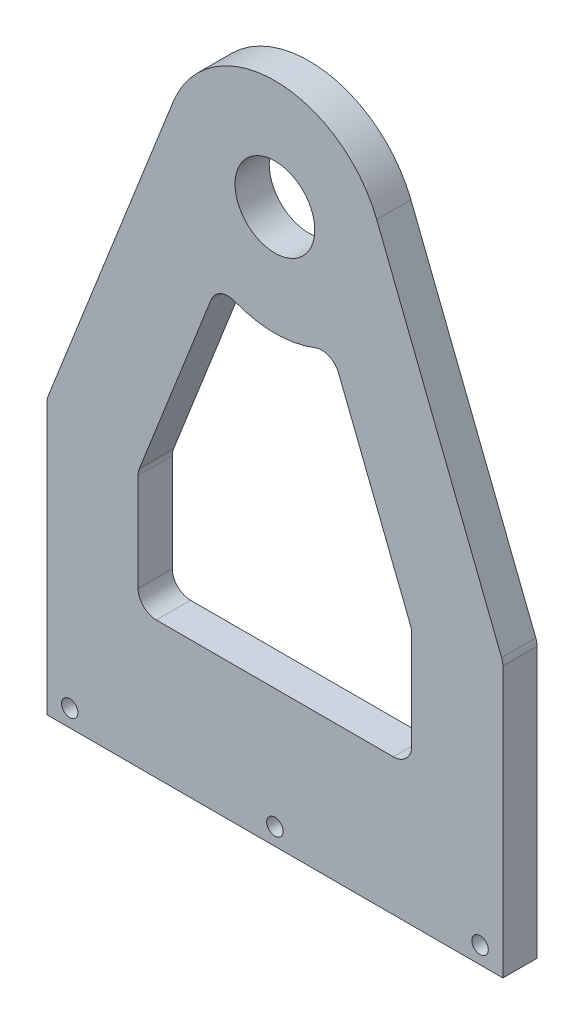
ISO-10303-21;
HEADER;
FILE_DESCRIPTION(('STEP AP214'),'2;1');
FILE_NAME('part.step','',(''),(''),'','','');
FILE_SCHEMA(('AUTOMOTIVE_DESIGN { 1 0 10303 214 1 1 1 1 }'));
ENDSEC;
DATA;
#1=APPLICATION_CONTEXT('core data for automotive mechanical design processes');
#2=APPLICATION_PROTOCOL_DEFINITION('international standard','automotive_design',2000,#1);
#3=PRODUCT_CONTEXT('',#1,'mechanical');
#4=PRODUCT('Part','Part','',(#3));
#5=PRODUCT_RELATED_PRODUCT_CATEGORY('part','',(#4));
#6=PRODUCT_DEFINITION_FORMATION('','',#4);
#7=PRODUCT_DEFINITION_CONTEXT('part definition',#1,'design');
#8=PRODUCT_DEFINITION('design','',#6,#7);
#9=PRODUCT_DEFINITION_SHAPE('','',#8);
#10=(LENGTH_UNIT() NAMED_UNIT(*) SI_UNIT(.MILLI.,.METRE.));
#11=(NAMED_UNIT(*) PLANE_ANGLE_UNIT() SI_UNIT($,.RADIAN.));
#12=(NAMED_UNIT(*) SI_UNIT($,.STERADIAN.) SOLID_ANGLE_UNIT());
#13=UNCERTAINTY_MEASURE_WITH_UNIT(LENGTH_MEASURE(1.E-05),#10,'distance_accuracy_value','');
#14=(GEOMETRIC_REPRESENTATION_CONTEXT(3) GLOBAL_UNCERTAINTY_ASSIGNED_CONTEXT((#13)) GLOBAL_UNIT_ASSIGNED_CONTEXT((#10,
#11,#12)) REPRESENTATION_CONTEXT('',''));
#15=CARTESIAN_POINT('',(0.,0.,0.));
#16=DIRECTION('',(0.,0.,1.));
#17=DIRECTION('',(1.,0.,0.));
#18=AXIS2_PLACEMENT_3D('',#15,#16,#17);
#19=CARTESIAN_POINT('',(0.,77.11694,4.7625));
#20=DIRECTION('',(0.,0.,-1.));
#21=DIRECTION('',(-1.,0.,0.));
#22=AXIS2_PLACEMENT_3D('',#19,#20,#21);
#23=PLANE('',#22);
#24=DIRECTION('',(0.,-1.,0.));
#25=VECTOR('',#24,1.);
#26=CARTESIAN_POINT('',(-19.05,35.6886922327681,4.7625));
#27=LINE('',#26,#25);
#28=CARTESIAN_POINT('',(-19.05,35.2064306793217,4.7625));
#29=VERTEX_POINT('',#28);
#30=CARTESIAN_POINT('',(-19.05,21.59,4.7625));
#31=VERTEX_POINT('',#30);
#32=EDGE_CURVE('E266',#29,#31,#27,.T.);
#33=ORIENTED_EDGE('',*,*,#32,.F.);
#34=CARTESIAN_POINT('',(-16.51,35.2064306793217,4.7625));
#35=DIRECTION('',(0.,0.,-1.));
#36=DIRECTION('',(-1.,0.,0.));
#37=AXIS2_PLACEMENT_3D('',#34,#35,#36);
#38=CIRCLE('',#37,2.54);
#39=CARTESIAN_POINT('',(-18.8732411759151,36.1373931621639,4.7625));
#40=VERTEX_POINT('',#39);
#41=EDGE_CURVE('E38',#29,#40,#38,.T.);
#42=ORIENTED_EDGE('',*,*,#41,.T.);
#43=DIRECTION('',(-0.366520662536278,-0.930409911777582,0.));
#44=VECTOR('',#43,1.);
#45=CARTESIAN_POINT('',(-7.87088949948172,64.0667791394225,4.7625));
#46=LINE('',#45,#44);
#47=CARTESIAN_POINT('',(-8.8799785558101,61.5052142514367,4.7625));
#48=VERTEX_POINT('',#47);
#49=EDGE_CURVE('E264',#48,#40,#46,.T.);
#50=ORIENTED_EDGE('',*,*,#49,.F.);
#51=CARTESIAN_POINT('',(-6.51673737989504,60.5742517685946,4.7625));
#52=DIRECTION('',(0.,0.,-1.));
#53=DIRECTION('',(-1.,0.,0.));
#54=AXIS2_PLACEMENT_3D('',#51,#52,#53);
#55=CIRCLE('',#54,2.54);
#56=CARTESIAN_POINT('',(-5.58577489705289,62.9374929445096,4.7625));
#57=VERTEX_POINT('',#56);
#58=EDGE_CURVE('E244',#48,#57,#55,.T.);
#59=ORIENTED_EDGE('',*,*,#58,.T.);
#60=CARTESIAN_POINT('',(0.,77.11694,4.7625));
#61=DIRECTION('',(0.,0.,-1.));
#62=DIRECTION('',(1.,0.,0.));
#63=AXIS2_PLACEMENT_3D('',#60,#61,#62);
#64=CIRCLE('',#63,15.24);
#65=CARTESIAN_POINT('',(5.58577489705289,62.9374929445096,4.7625));
#66=VERTEX_POINT('',#65);
#67=EDGE_CURVE('E294',#66,#57,#64,.T.);
#68=ORIENTED_EDGE('',*,*,#67,.F.);
#69=CARTESIAN_POINT('',(6.51673737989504,60.5742517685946,4.7625));
#70=DIRECTION('',(0.,0.,-1.));
#71=DIRECTION('',(-1.,0.,0.));
#72=AXIS2_PLACEMENT_3D('',#69,#70,#71);
#73=CIRCLE('',#72,2.54);
#74=CARTESIAN_POINT('',(8.8799785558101,61.5052142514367,4.7625));
#75=VERTEX_POINT('',#74);
#76=EDGE_CURVE('E240',#66,#75,#73,.T.);
#77=ORIENTED_EDGE('',*,*,#76,.T.);
#78=DIRECTION('',(-0.366520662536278,0.930409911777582,0.));
#79=VECTOR('',#78,1.);
#80=CARTESIAN_POINT('',(19.05,35.6886922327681,4.7625));
#81=LINE('',#80,#79);
#82=CARTESIAN_POINT('',(18.8732411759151,36.1373931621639,4.7625));
#83=VERTEX_POINT('',#82);
#84=EDGE_CURVE('E312',#83,#75,#81,.T.);
#85=ORIENTED_EDGE('',*,*,#84,.F.);
#86=CARTESIAN_POINT('',(16.51,35.2064306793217,4.7625));
#87=DIRECTION('',(0.,0.,-1.));
#88=DIRECTION('',(-1.,0.,0.));
#89=AXIS2_PLACEMENT_3D('',#86,#87,#88);
#90=CIRCLE('',#89,2.54);
#91=CARTESIAN_POINT('',(19.05,35.2064306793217,4.7625));
#92=VERTEX_POINT('',#91);
#93=EDGE_CURVE('E248',#83,#92,#90,.T.);
#94=ORIENTED_EDGE('',*,*,#93,.T.);
#95=DIRECTION('',(0.,1.,0.));
#96=VECTOR('',#95,1.);
#97=CARTESIAN_POINT('',(19.05,19.05,4.7625));
#98=LINE('',#97,#96);
#99=CARTESIAN_POINT('',(19.05,21.59,4.7625));
#100=VERTEX_POINT('',#99);
#101=EDGE_CURVE('E309',#100,#92,#98,.T.);
#102=ORIENTED_EDGE('',*,*,#101,.F.);
#103=CARTESIAN_POINT('',(16.51,21.59,4.7625));
#104=DIRECTION('',(0.,0.,-1.));
#105=DIRECTION('',(-1.,0.,0.));
#106=AXIS2_PLACEMENT_3D('',#103,#104,#105);
#107=CIRCLE('',#106,2.54);
#108=CARTESIAN_POINT('',(16.51,19.05,4.7625));
#109=VERTEX_POINT('',#108);
#110=EDGE_CURVE('E252',#100,#109,#107,.T.);
#111=ORIENTED_EDGE('',*,*,#110,.T.);
#112=DIRECTION('',(1.,0.,0.));
#113=VECTOR('',#112,1.);
#114=CARTESIAN_POINT('',(-19.05,19.05,4.7625));
#115=LINE('',#114,#113);
#116=CARTESIAN_POINT('',(-16.51,19.05,4.7625));
#117=VERTEX_POINT('',#116);
#118=EDGE_CURVE('E306',#117,#109,#115,.T.);
#119=ORIENTED_EDGE('',*,*,#118,.F.);
#120=CARTESIAN_POINT('',(-16.51,21.59,4.7625));
#121=DIRECTION('',(0.,0.,-1.));
#122=DIRECTION('',(-1.,0.,0.));
#123=AXIS2_PLACEMENT_3D('',#120,#121,#122);
#124=CIRCLE('',#123,2.54);
#125=EDGE_CURVE('E256',#117,#31,#124,.T.);
#126=ORIENTED_EDGE('',*,*,#125,.T.);
#127=EDGE_LOOP('',(#33,#42,#50,#59,#68,#77,#85,#94,#102,#111,#119,#126));
#128=FACE_BOUND('',#127,.T.);
#129=CARTESIAN_POINT('',(0.,2.38125,4.7625));
#130=DIRECTION('',(0.,0.,1.));
#131=DIRECTION('',(1.,0.,0.));
#132=AXIS2_PLACEMENT_3D('',#129,#130,#131);
#133=CIRCLE('',#132,1.143);
#134=CARTESIAN_POINT('',(1.14300000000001,2.38125,4.7625));
#135=VERTEX_POINT('',#134);
#136=EDGE_CURVE('E303',#135,#135,#133,.T.);
#137=ORIENTED_EDGE('',*,*,#136,.F.);
#138=EDGE_LOOP('',(#137));
#139=FACE_BOUND('',#138,.T.);
#140=CARTESIAN_POINT('',(28.575,2.38125,4.7625));
#141=DIRECTION('',(0.,0.,1.));
#142=DIRECTION('',(-1.,0.,0.));
#143=AXIS2_PLACEMENT_3D('',#140,#141,#142);
#144=CIRCLE('',#143,1.143);
#145=CARTESIAN_POINT('',(29.718,2.38125,4.7625));
#146=VERTEX_POINT('',#145);
#147=EDGE_CURVE('E320',#146,#146,#144,.T.);
#148=ORIENTED_EDGE('',*,*,#147,.F.);
#149=EDGE_LOOP('',(#148));
#150=FACE_BOUND('',#149,.T.);
#151=CARTESIAN_POINT('',(-28.575,2.38125,4.7625));
#152=DIRECTION('',(0.,0.,1.));
#153=DIRECTION('',(1.,0.,0.));
#154=AXIS2_PLACEMENT_3D('',#151,#152,#153);
#155=CIRCLE('',#154,1.143);
#156=CARTESIAN_POINT('',(-27.432,2.38125,4.7625));
#157=VERTEX_POINT('',#156);
#158=EDGE_CURVE('E326',#157,#157,#155,.T.);
#159=ORIENTED_EDGE('',*,*,#158,.F.);
#160=EDGE_LOOP('',(#159));
#161=FACE_BOUND('',#160,.T.);
#162=DIRECTION('',(0.,1.,0.));
#163=VECTOR('',#162,1.);
#164=CARTESIAN_POINT('',(31.75,0.,4.7625));
#165=LINE('',#164,#163);
#166=CARTESIAN_POINT('',(31.75,0.,4.7625));
#167=VERTEX_POINT('',#166);
#168=CARTESIAN_POINT('',(31.75,37.6177384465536,4.7625));
#169=VERTEX_POINT('',#168);
#170=EDGE_CURVE('E184',#167,#169,#165,.T.);
#171=ORIENTED_EDGE('',*,*,#170,.T.);
#172=CARTESIAN_POINT('',(29.21,37.6177384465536,4.7625));
#173=DIRECTION('',(0.,0.,-1.));
#174=DIRECTION('',(-1.,0.,0.));
#175=AXIS2_PLACEMENT_3D('',#172,#173,#174);
#176=CIRCLE('',#175,2.54);
#177=CARTESIAN_POINT('',(31.5732411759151,38.5487009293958,4.7625));
#178=VERTEX_POINT('',#177);
#179=EDGE_CURVE('E205',#169,#178,#176,.F.);
#180=ORIENTED_EDGE('',*,*,#179,.T.);
#181=DIRECTION('',(-0.366520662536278,0.930409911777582,0.));
#182=VECTOR('',#181,1.);
#183=CARTESIAN_POINT('',(31.75,38.1,4.7625));
#184=LINE('',#183,#182);
#185=CARTESIAN_POINT('',(14.1794470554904,82.7027148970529,4.7625));
#186=VERTEX_POINT('',#185);
#187=EDGE_CURVE('E341',#178,#186,#184,.T.);
#188=ORIENTED_EDGE('',*,*,#187,.T.);
#189=CARTESIAN_POINT('',(0.,77.11694,4.7625));
#190=DIRECTION('',(0.,0.,1.));
#191=DIRECTION('',(-1.,0.,0.));
#192=AXIS2_PLACEMENT_3D('',#189,#190,#191);
#193=CIRCLE('',#192,15.24);
#194=CARTESIAN_POINT('',(-14.1794470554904,82.7027148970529,4.7625));
#195=VERTEX_POINT('',#194);
#196=EDGE_CURVE('E343',#186,#195,#193,.T.);
#197=ORIENTED_EDGE('',*,*,#196,.T.);
#198=DIRECTION('',(-0.366520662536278,-0.930409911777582,0.));
#199=VECTOR('',#198,1.);
#200=CARTESIAN_POINT('',(-31.75,38.1,4.7625));
#201=LINE('',#200,#199);
#202=CARTESIAN_POINT('',(-31.5732411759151,38.5487009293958,4.7625));
#203=VERTEX_POINT('',#202);
#204=EDGE_CURVE('E345',#195,#203,#201,.T.);
#205=ORIENTED_EDGE('',*,*,#204,.T.);
#206=CARTESIAN_POINT('',(-29.21,37.6177384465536,4.7625));
#207=DIRECTION('',(0.,0.,-1.));
#208=DIRECTION('',(-1.,0.,0.));
#209=AXIS2_PLACEMENT_3D('',#206,#207,#208);
#210=CIRCLE('',#209,2.54);
#211=CARTESIAN_POINT('',(-31.75,37.6177384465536,4.7625));
#212=VERTEX_POINT('',#211);
#213=EDGE_CURVE('E52',#203,#212,#210,.F.);
#214=ORIENTED_EDGE('',*,*,#213,.T.);
#215=DIRECTION('',(0.,-1.,0.));
#216=VECTOR('',#215,1.);
#217=CARTESIAN_POINT('',(-31.75,0.,4.7625));
#218=LINE('',#217,#216);
#219=CARTESIAN_POINT('',(-31.75,0.,4.7625));
#220=VERTEX_POINT('',#219);
#221=EDGE_CURVE('E165',#212,#220,#218,.T.);
#222=ORIENTED_EDGE('',*,*,#221,.T.);
#223=DIRECTION('',(1.,0.,0.));
#224=VECTOR('',#223,1.);
#225=CARTESIAN_POINT('',(-31.75,0.,4.7625));
#226=LINE('',#225,#224);
#227=EDGE_CURVE('E169',#220,#167,#226,.T.);
#228=ORIENTED_EDGE('',*,*,#227,.T.);
#229=EDGE_LOOP('',(#171,#180,#188,#197,#205,#214,#222,#228));
#230=FACE_BOUND('',#229,.T.);
#231=CARTESIAN_POINT('',(0.,77.11694,4.7625));
#232=DIRECTION('',(0.,0.,1.));
#233=DIRECTION('',(1.,0.,0.));
#234=AXIS2_PLACEMENT_3D('',#231,#232,#233);
#235=CIRCLE('',#234,5.55625);
#236=CARTESIAN_POINT('',(-5.55625,77.11694,4.7625));
#237=VERTEX_POINT('',#236);
#238=EDGE_CURVE('E335',#237,#237,#235,.T.);
#239=ORIENTED_EDGE('',*,*,#238,.F.);
#240=EDGE_LOOP('',(#239));
#241=FACE_BOUND('',#240,.T.);
#242=ADVANCED_FACE('F30',(#128,#139,#150,#161,#230,#241),#23,.F.);
#243=CARTESIAN_POINT('',(0.,77.11694,0.));
#244=DIRECTION('',(0.,0.,-1.));
#245=DIRECTION('',(-1.,0.,0.));
#246=AXIS2_PLACEMENT_3D('',#243,#244,#245);
#247=PLANE('',#246);
#248=CARTESIAN_POINT('',(0.,77.11694,0.));
#249=DIRECTION('',(0.,0.,-1.));
#250=DIRECTION('',(1.,0.,0.));
#251=AXIS2_PLACEMENT_3D('',#248,#249,#250);
#252=CIRCLE('',#251,15.24);
#253=CARTESIAN_POINT('',(5.58577489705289,62.9374929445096,0.));
#254=VERTEX_POINT('',#253);
#255=CARTESIAN_POINT('',(-5.58577489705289,62.9374929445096,0.));
#256=VERTEX_POINT('',#255);
#257=EDGE_CURVE('E302',#254,#256,#252,.T.);
#258=ORIENTED_EDGE('',*,*,#257,.T.);
#259=CARTESIAN_POINT('',(-6.51673737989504,60.5742517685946,0.));
#260=DIRECTION('',(0.,0.,-1.));
#261=DIRECTION('',(-1.,0.,0.));
#262=AXIS2_PLACEMENT_3D('',#259,#260,#261);
#263=CIRCLE('',#262,2.54);
#264=CARTESIAN_POINT('',(-8.8799785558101,61.5052142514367,0.));
#265=VERTEX_POINT('',#264);
#266=EDGE_CURVE('E246',#256,#265,#263,.F.);
#267=ORIENTED_EDGE('',*,*,#266,.T.);
#268=DIRECTION('',(-0.366520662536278,-0.930409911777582,0.));
#269=VECTOR('',#268,1.);
#270=CARTESIAN_POINT('',(-7.87088949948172,64.0667791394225,0.));
#271=LINE('',#270,#269);
#272=CARTESIAN_POINT('',(-18.8732411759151,36.1373931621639,0.));
#273=VERTEX_POINT('',#272);
#274=EDGE_CURVE('E285',#265,#273,#271,.T.);
#275=ORIENTED_EDGE('',*,*,#274,.T.);
#276=CARTESIAN_POINT('',(-16.51,35.2064306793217,0.));
#277=DIRECTION('',(0.,0.,-1.));
#278=DIRECTION('',(-1.,0.,0.));
#279=AXIS2_PLACEMENT_3D('',#276,#277,#278);
#280=CIRCLE('',#279,2.54);
#281=CARTESIAN_POINT('',(-19.05,35.2064306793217,0.));
#282=VERTEX_POINT('',#281);
#283=EDGE_CURVE('E11',#273,#282,#280,.F.);
#284=ORIENTED_EDGE('',*,*,#283,.T.);
#285=DIRECTION('',(0.,-1.,0.));
#286=VECTOR('',#285,1.);
#287=CARTESIAN_POINT('',(-19.05,35.6886922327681,0.));
#288=LINE('',#287,#286);
#289=CARTESIAN_POINT('',(-19.05,21.59,0.));
#290=VERTEX_POINT('',#289);
#291=EDGE_CURVE('E283',#282,#290,#288,.T.);
#292=ORIENTED_EDGE('',*,*,#291,.T.);
#293=CARTESIAN_POINT('',(-16.51,21.59,0.));
#294=DIRECTION('',(0.,0.,-1.));
#295=DIRECTION('',(-1.,0.,0.));
#296=AXIS2_PLACEMENT_3D('',#293,#294,#295);
#297=CIRCLE('',#296,2.54);
#298=CARTESIAN_POINT('',(-16.51,19.05,0.));
#299=VERTEX_POINT('',#298);
#300=EDGE_CURVE('E258',#290,#299,#297,.F.);
#301=ORIENTED_EDGE('',*,*,#300,.T.);
#302=DIRECTION('',(1.,0.,0.));
#303=VECTOR('',#302,1.);
#304=CARTESIAN_POINT('',(-19.05,19.05,0.));
#305=LINE('',#304,#303);
#306=CARTESIAN_POINT('',(16.51,19.05,0.));
#307=VERTEX_POINT('',#306);
#308=EDGE_CURVE('E289',#299,#307,#305,.T.);
#309=ORIENTED_EDGE('',*,*,#308,.T.);
#310=CARTESIAN_POINT('',(16.51,21.59,0.));
#311=DIRECTION('',(0.,0.,-1.));
#312=DIRECTION('',(-1.,0.,0.));
#313=AXIS2_PLACEMENT_3D('',#310,#311,#312);
#314=CIRCLE('',#313,2.54);
#315=CARTESIAN_POINT('',(19.05,21.59,0.));
#316=VERTEX_POINT('',#315);
#317=EDGE_CURVE('E254',#307,#316,#314,.F.);
#318=ORIENTED_EDGE('',*,*,#317,.T.);
#319=DIRECTION('',(0.,1.,0.));
#320=VECTOR('',#319,1.);
#321=CARTESIAN_POINT('',(19.05,19.05,0.));
#322=LINE('',#321,#320);
#323=CARTESIAN_POINT('',(19.05,35.2064306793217,0.));
#324=VERTEX_POINT('',#323);
#325=EDGE_CURVE('E292',#316,#324,#322,.T.);
#326=ORIENTED_EDGE('',*,*,#325,.T.);
#327=CARTESIAN_POINT('',(16.51,35.2064306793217,0.));
#328=DIRECTION('',(0.,0.,-1.));
#329=DIRECTION('',(-1.,0.,0.));
#330=AXIS2_PLACEMENT_3D('',#327,#328,#329);
#331=CIRCLE('',#330,2.54);
#332=CARTESIAN_POINT('',(18.8732411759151,36.1373931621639,0.));
#333=VERTEX_POINT('',#332);
#334=EDGE_CURVE('E250',#324,#333,#331,.F.);
#335=ORIENTED_EDGE('',*,*,#334,.T.);
#336=DIRECTION('',(-0.366520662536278,0.930409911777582,0.));
#337=VECTOR('',#336,1.);
#338=CARTESIAN_POINT('',(19.05,35.6886922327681,0.));
#339=LINE('',#338,#337);
#340=CARTESIAN_POINT('',(8.8799785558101,61.5052142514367,0.));
#341=VERTEX_POINT('',#340);
#342=EDGE_CURVE('E299',#333,#341,#339,.T.);
#343=ORIENTED_EDGE('',*,*,#342,.T.);
#344=CARTESIAN_POINT('',(6.51673737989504,60.5742517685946,0.));
#345=DIRECTION('',(0.,0.,-1.));
#346=DIRECTION('',(-1.,0.,0.));
#347=AXIS2_PLACEMENT_3D('',#344,#345,#346);
#348=CIRCLE('',#347,2.54);
#349=EDGE_CURVE('E242',#341,#254,#348,.F.);
#350=ORIENTED_EDGE('',*,*,#349,.T.);
#351=EDGE_LOOP('',(#258,#267,#275,#284,#292,#301,#309,#318,#326,#335,#343,#350));
#352=FACE_BOUND('',#351,.T.);
#353=CARTESIAN_POINT('',(0.,2.38125,0.));
#354=DIRECTION('',(0.,0.,1.));
#355=DIRECTION('',(1.,0.,0.));
#356=AXIS2_PLACEMENT_3D('',#353,#354,#355);
#357=CIRCLE('',#356,1.143);
#358=CARTESIAN_POINT('',(1.14300000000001,2.38125,0.));
#359=VERTEX_POINT('',#358);
#360=EDGE_CURVE('E317',#359,#359,#357,.T.);
#361=ORIENTED_EDGE('',*,*,#360,.T.);
#362=EDGE_LOOP('',(#361));
#363=FACE_BOUND('',#362,.T.);
#364=CARTESIAN_POINT('',(28.575,2.38125,0.));
#365=DIRECTION('',(0.,0.,1.));
#366=DIRECTION('',(-1.,0.,0.));
#367=AXIS2_PLACEMENT_3D('',#364,#365,#366);
#368=CIRCLE('',#367,1.143);
#369=CARTESIAN_POINT('',(29.718,2.38125,0.));
#370=VERTEX_POINT('',#369);
#371=EDGE_CURVE('E323',#370,#370,#368,.T.);
#372=ORIENTED_EDGE('',*,*,#371,.T.);
#373=EDGE_LOOP('',(#372));
#374=FACE_BOUND('',#373,.T.);
#375=CARTESIAN_POINT('',(-28.575,2.38125,0.));
#376=DIRECTION('',(0.,0.,1.));
#377=DIRECTION('',(1.,0.,0.));
#378=AXIS2_PLACEMENT_3D('',#375,#376,#377);
#379=CIRCLE('',#378,1.143);
#380=CARTESIAN_POINT('',(-27.432,2.38125,0.));
#381=VERTEX_POINT('',#380);
#382=EDGE_CURVE('E329',#381,#381,#379,.T.);
#383=ORIENTED_EDGE('',*,*,#382,.T.);
#384=EDGE_LOOP('',(#383));
#385=FACE_BOUND('',#384,.T.);
#386=DIRECTION('',(-0.366520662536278,0.930409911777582,0.));
#387=VECTOR('',#386,1.);
#388=CARTESIAN_POINT('',(31.75,38.1,0.));
#389=LINE('',#388,#387);
#390=CARTESIAN_POINT('',(31.5732411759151,38.5487009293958,0.));
#391=VERTEX_POINT('',#390);
#392=CARTESIAN_POINT('',(14.1794470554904,82.7027148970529,0.));
#393=VERTEX_POINT('',#392);
#394=EDGE_CURVE('E354',#391,#393,#389,.T.);
#395=ORIENTED_EDGE('',*,*,#394,.F.);
#396=CARTESIAN_POINT('',(29.21,37.6177384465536,0.));
#397=DIRECTION('',(0.,0.,-1.));
#398=DIRECTION('',(-1.,0.,0.));
#399=AXIS2_PLACEMENT_3D('',#396,#397,#398);
#400=CIRCLE('',#399,2.54);
#401=CARTESIAN_POINT('',(31.75,37.6177384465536,0.));
#402=VERTEX_POINT('',#401);
#403=EDGE_CURVE('E200',#391,#402,#400,.T.);
#404=ORIENTED_EDGE('',*,*,#403,.T.);
#405=DIRECTION('',(0.,1.,0.));
#406=VECTOR('',#405,1.);
#407=CARTESIAN_POINT('',(31.75,0.,0.));
#408=LINE('',#407,#406);
#409=CARTESIAN_POINT('',(31.75,0.,0.));
#410=VERTEX_POINT('',#409);
#411=EDGE_CURVE('E351',#410,#402,#408,.T.);
#412=ORIENTED_EDGE('',*,*,#411,.F.);
#413=DIRECTION('',(1.,0.,0.));
#414=VECTOR('',#413,1.);
#415=CARTESIAN_POINT('',(-31.75,0.,0.));
#416=LINE('',#415,#414);
#417=CARTESIAN_POINT('',(-31.75,0.,0.));
#418=VERTEX_POINT('',#417);
#419=EDGE_CURVE('E349',#418,#410,#416,.T.);
#420=ORIENTED_EDGE('',*,*,#419,.F.);
#421=DIRECTION('',(0.,-1.,0.));
#422=VECTOR('',#421,1.);
#423=CARTESIAN_POINT('',(-31.75,0.,0.));
#424=LINE('',#423,#422);
#425=CARTESIAN_POINT('',(-31.75,37.6177384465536,0.));
#426=VERTEX_POINT('',#425);
#427=EDGE_CURVE('E188',#426,#418,#424,.T.);
#428=ORIENTED_EDGE('',*,*,#427,.F.);
#429=CARTESIAN_POINT('',(-29.21,37.6177384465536,0.));
#430=DIRECTION('',(0.,0.,-1.));
#431=DIRECTION('',(-1.,0.,0.));
#432=AXIS2_PLACEMENT_3D('',#429,#430,#431);
#433=CIRCLE('',#432,2.54);
#434=CARTESIAN_POINT('',(-31.5732411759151,38.5487009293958,0.));
#435=VERTEX_POINT('',#434);
#436=EDGE_CURVE('E193',#426,#435,#433,.T.);
#437=ORIENTED_EDGE('',*,*,#436,.T.);
#438=DIRECTION('',(-0.366520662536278,-0.930409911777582,0.));
#439=VECTOR('',#438,1.);
#440=CARTESIAN_POINT('',(-31.75,38.1,0.));
#441=LINE('',#440,#439);
#442=CARTESIAN_POINT('',(-14.1794470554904,82.7027148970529,0.));
#443=VERTEX_POINT('',#442);
#444=EDGE_CURVE('E175',#443,#435,#441,.T.);
#445=ORIENTED_EDGE('',*,*,#444,.F.);
#446=CARTESIAN_POINT('',(0.,77.11694,0.));
#447=DIRECTION('',(0.,0.,1.));
#448=DIRECTION('',(-1.,0.,0.));
#449=AXIS2_PLACEMENT_3D('',#446,#447,#448);
#450=CIRCLE('',#449,15.24);
#451=EDGE_CURVE('E356',#393,#443,#450,.T.);
#452=ORIENTED_EDGE('',*,*,#451,.F.);
#453=EDGE_LOOP('',(#395,#404,#412,#420,#428,#437,#445,#452));
#454=FACE_BOUND('',#453,.T.);
#455=CARTESIAN_POINT('',(0.,77.11694,0.));
#456=DIRECTION('',(0.,0.,1.));
#457=DIRECTION('',(1.,0.,0.));
#458=AXIS2_PLACEMENT_3D('',#455,#456,#457);
#459=CIRCLE('',#458,5.55625);
#460=CARTESIAN_POINT('',(-5.55625,77.11694,0.));
#461=VERTEX_POINT('',#460);
#462=EDGE_CURVE('E332',#461,#461,#459,.T.);
#463=ORIENTED_EDGE('',*,*,#462,.T.);
#464=EDGE_LOOP('',(#463));
#465=FACE_BOUND('',#464,.T.);
#466=ADVANCED_FACE('F281',(#352,#363,#374,#385,#454,#465),#247,.T.);
#467=CARTESIAN_POINT('',(-31.75,0.,4.7625));
#468=DIRECTION('',(1.,0.,0.));
#469=DIRECTION('',(0.,0.,-1.));
#470=AXIS2_PLACEMENT_3D('',#467,#468,#469);
#471=PLANE('',#470);
#472=ORIENTED_EDGE('',*,*,#221,.F.);
#473=DIRECTION('',(0.,0.,-1.));
#474=VECTOR('',#473,1.);
#475=CARTESIAN_POINT('',(-31.75,37.6177384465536,4.7625));
#476=LINE('',#475,#474);
#477=EDGE_CURVE('E207',#212,#426,#476,.T.);
#478=ORIENTED_EDGE('',*,*,#477,.T.);
#479=ORIENTED_EDGE('',*,*,#427,.T.);
#480=DIRECTION('',(0.,0.,-1.));
#481=VECTOR('',#480,1.);
#482=CARTESIAN_POINT('',(-31.75,0.,4.7625));
#483=LINE('',#482,#481);
#484=EDGE_CURVE('E180',#220,#418,#483,.T.);
#485=ORIENTED_EDGE('',*,*,#484,.F.);
#486=EDGE_LOOP('',(#472,#478,#479,#485));
#487=FACE_BOUND('',#486,.T.);
#488=ADVANCED_FACE('F186',(#487),#471,.F.);
#489=CARTESIAN_POINT('',(-31.75,0.,4.7625));
#490=DIRECTION('',(0.,1.,0.));
#491=DIRECTION('',(0.,0.,1.));
#492=AXIS2_PLACEMENT_3D('',#489,#490,#491);
#493=PLANE('',#492);
#494=ORIENTED_EDGE('',*,*,#419,.T.);
#495=DIRECTION('',(0.,0.,-1.));
#496=VECTOR('',#495,1.);
#497=CARTESIAN_POINT('',(31.75,0.,4.7625));
#498=LINE('',#497,#496);
#499=EDGE_CURVE('E182',#167,#410,#498,.T.);
#500=ORIENTED_EDGE('',*,*,#499,.F.);
#501=ORIENTED_EDGE('',*,*,#227,.F.);
#502=ORIENTED_EDGE('',*,*,#484,.T.);
#503=EDGE_LOOP('',(#494,#500,#501,#502));
#504=FACE_BOUND('',#503,.T.);
#505=ADVANCED_FACE('F179',(#504),#493,.F.);
#506=CARTESIAN_POINT('',(31.75,0.,4.7625));
#507=DIRECTION('',(-1.,0.,0.));
#508=DIRECTION('',(0.,0.,1.));
#509=AXIS2_PLACEMENT_3D('',#506,#507,#508);
#510=PLANE('',#509);
#511=ORIENTED_EDGE('',*,*,#411,.T.);
#512=DIRECTION('',(0.,0.,-1.));
#513=VECTOR('',#512,1.);
#514=CARTESIAN_POINT('',(31.75,37.6177384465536,4.7625));
#515=LINE('',#514,#513);
#516=EDGE_CURVE('E202',#402,#169,#515,.F.);
#517=ORIENTED_EDGE('',*,*,#516,.T.);
#518=ORIENTED_EDGE('',*,*,#170,.F.);
#519=ORIENTED_EDGE('',*,*,#499,.T.);
#520=EDGE_LOOP('',(#511,#517,#518,#519));
#521=FACE_BOUND('',#520,.T.);
#522=ADVANCED_FACE('F378',(#521),#510,.F.);
#523=CARTESIAN_POINT('',(31.75,38.1,4.7625));
#524=DIRECTION('',(-0.930409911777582,-0.366520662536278,0.));
#525=DIRECTION('',(0.366520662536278,-0.930409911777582,0.));
#526=AXIS2_PLACEMENT_3D('',#523,#524,#525);
#527=PLANE('',#526);
#528=ORIENTED_EDGE('',*,*,#187,.F.);
#529=DIRECTION('',(0.,0.,-1.));
#530=VECTOR('',#529,1.);
#531=CARTESIAN_POINT('',(31.5732411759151,38.5487009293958,4.7625));
#532=LINE('',#531,#530);
#533=EDGE_CURVE('E190',#178,#391,#532,.T.);
#534=ORIENTED_EDGE('',*,*,#533,.T.);
#535=ORIENTED_EDGE('',*,*,#394,.T.);
#536=DIRECTION('',(0.,0.,-1.));
#537=VECTOR('',#536,1.);
#538=CARTESIAN_POINT('',(14.1794470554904,82.7027148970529,4.7625));
#539=LINE('',#538,#537);
#540=EDGE_CURVE('E195',#186,#393,#539,.T.);
#541=ORIENTED_EDGE('',*,*,#540,.F.);
#542=EDGE_LOOP('',(#528,#534,#535,#541));
#543=FACE_BOUND('',#542,.T.);
#544=ADVANCED_FACE('F384',(#543),#527,.F.);
#545=CARTESIAN_POINT('',(0.,77.11694,4.7625));
#546=DIRECTION('',(0.,0.,-1.));
#547=DIRECTION('',(-1.,0.,0.));
#548=AXIS2_PLACEMENT_3D('',#545,#546,#547);
#549=CYLINDRICAL_SURFACE('',#548,15.24);
#550=ORIENTED_EDGE('',*,*,#451,.T.);
#551=DIRECTION('',(0.,0.,-1.));
#552=VECTOR('',#551,1.);
#553=CARTESIAN_POINT('',(-14.1794470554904,82.7027148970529,4.7625));
#554=LINE('',#553,#552);
#555=EDGE_CURVE('E347',#195,#443,#554,.T.);
#556=ORIENTED_EDGE('',*,*,#555,.F.);
#557=ORIENTED_EDGE('',*,*,#196,.F.);
#558=ORIENTED_EDGE('',*,*,#540,.T.);
#559=EDGE_LOOP('',(#550,#556,#557,#558));
#560=FACE_BOUND('',#559,.T.);
#561=ADVANCED_FACE('F365',(#560),#549,.T.);
#562=CARTESIAN_POINT('',(-31.75,38.1,4.7625));
#563=DIRECTION('',(0.930409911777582,-0.366520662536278,0.));
#564=DIRECTION('',(0.366520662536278,0.930409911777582,0.));
#565=AXIS2_PLACEMENT_3D('',#562,#563,#564);
#566=PLANE('',#565);
#567=ORIENTED_EDGE('',*,*,#444,.T.);
#568=DIRECTION('',(0.,0.,-1.));
#569=VECTOR('',#568,1.);
#570=CARTESIAN_POINT('',(-31.5732411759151,38.5487009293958,4.7625));
#571=LINE('',#570,#569);
#572=EDGE_CURVE('E45',#435,#203,#571,.F.);
#573=ORIENTED_EDGE('',*,*,#572,.T.);
#574=ORIENTED_EDGE('',*,*,#204,.F.);
#575=ORIENTED_EDGE('',*,*,#555,.T.);
#576=EDGE_LOOP('',(#567,#573,#574,#575));
#577=FACE_BOUND('',#576,.T.);
#578=ADVANCED_FACE('F373',(#577),#566,.F.);
#579=CARTESIAN_POINT('',(0.,77.11694,4.7625));
#580=DIRECTION('',(0.,0.,-1.));
#581=DIRECTION('',(-1.,0.,0.));
#582=AXIS2_PLACEMENT_3D('',#579,#580,#581);
#583=CYLINDRICAL_SURFACE('',#582,5.55625);
#584=CARTESIAN_POINT('',(-5.55625,77.11694,4.7625));
#585=CARTESIAN_POINT('',(-5.55625,77.11694,4.712890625));
#586=CARTESIAN_POINT('',(-5.55625,77.11694,4.66328125));
#587=CARTESIAN_POINT('',(-5.55625,77.11694,4.5640625));
#588=CARTESIAN_POINT('',(-5.55625,77.11694,4.514453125));
#589=CARTESIAN_POINT('',(-5.55625,77.11694,4.415234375));
#590=CARTESIAN_POINT('',(-5.55625,77.11694,4.365625));
#591=CARTESIAN_POINT('',(-5.55625,77.11694,4.26640625));
#592=CARTESIAN_POINT('',(-5.55625,77.11694,4.216796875));
#593=CARTESIAN_POINT('',(-5.55625,77.11694,4.117578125));
#594=CARTESIAN_POINT('',(-5.55625,77.11694,4.06796875));
#595=CARTESIAN_POINT('',(-5.55625,77.11694,3.96875));
#596=CARTESIAN_POINT('',(-5.55625,77.11694,3.919140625));
#597=CARTESIAN_POINT('',(-5.55625,77.11694,3.819921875));
#598=CARTESIAN_POINT('',(-5.55625,77.11694,3.7703125));
#599=CARTESIAN_POINT('',(-5.55625,77.11694,3.67109375));
#600=CARTESIAN_POINT('',(-5.55625,77.11694,3.621484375));
#601=CARTESIAN_POINT('',(-5.55625,77.11694,3.522265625));
#602=CARTESIAN_POINT('',(-5.55625,77.11694,3.47265625));
#603=CARTESIAN_POINT('',(-5.55625,77.11694,3.3734375));
#604=CARTESIAN_POINT('',(-5.55625,77.11694,3.323828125));
#605=CARTESIAN_POINT('',(-5.55625,77.11694,3.224609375));
#606=CARTESIAN_POINT('',(-5.55625,77.11694,3.175));
#607=CARTESIAN_POINT('',(-5.55625,77.11694,3.07578125));
#608=CARTESIAN_POINT('',(-5.55625,77.11694,3.026171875));
#609=CARTESIAN_POINT('',(-5.55625,77.11694,2.926953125));
#610=CARTESIAN_POINT('',(-5.55625,77.11694,2.87734375));
#611=CARTESIAN_POINT('',(-5.55625,77.11694,2.778125));
#612=CARTESIAN_POINT('',(-5.55625,77.11694,2.728515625));
#613=CARTESIAN_POINT('',(-5.55625,77.11694,2.629296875));
#614=CARTESIAN_POINT('',(-5.55625,77.11694,2.5796875));
#615=CARTESIAN_POINT('',(-5.55625,77.11694,2.48046875));
#616=CARTESIAN_POINT('',(-5.55625,77.11694,2.430859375));
#617=CARTESIAN_POINT('',(-5.55625,77.11694,2.331640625));
#618=CARTESIAN_POINT('',(-5.55625,77.11694,2.28203125));
#619=CARTESIAN_POINT('',(-5.55625,77.11694,2.1828125));
#620=CARTESIAN_POINT('',(-5.55625,77.11694,2.133203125));
#621=CARTESIAN_POINT('',(-5.55625,77.11694,2.033984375));
#622=CARTESIAN_POINT('',(-5.55625,77.11694,1.984375));
#623=CARTESIAN_POINT('',(-5.55625,77.11694,1.88515625));
#624=CARTESIAN_POINT('',(-5.55625,77.11694,1.835546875));
#625=CARTESIAN_POINT('',(-5.55625,77.11694,1.736328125));
#626=CARTESIAN_POINT('',(-5.55625,77.11694,1.68671875));
#627=CARTESIAN_POINT('',(-5.55625,77.11694,1.5875));
#628=CARTESIAN_POINT('',(-5.55625,77.11694,1.537890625));
#629=CARTESIAN_POINT('',(-5.55625,77.11694,1.438671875));
#630=CARTESIAN_POINT('',(-5.55625,77.11694,1.3890625));
#631=CARTESIAN_POINT('',(-5.55625,77.11694,1.28984375));
#632=CARTESIAN_POINT('',(-5.55625,77.11694,1.240234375));
#633=CARTESIAN_POINT('',(-5.55625,77.11694,1.141015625));
#634=CARTESIAN_POINT('',(-5.55625,77.11694,1.09140625));
#635=CARTESIAN_POINT('',(-5.55625,77.11694,0.9921875));
#636=CARTESIAN_POINT('',(-5.55625,77.11694,0.942578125));
#637=CARTESIAN_POINT('',(-5.55625,77.11694,0.843359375));
#638=CARTESIAN_POINT('',(-5.55625,77.11694,0.79375));
#639=CARTESIAN_POINT('',(-5.55625,77.11694,0.69453125));
#640=CARTESIAN_POINT('',(-5.55625,77.11694,0.644921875));
#641=CARTESIAN_POINT('',(-5.55625,77.11694,0.545703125));
#642=CARTESIAN_POINT('',(-5.55625,77.11694,0.49609375));
#643=CARTESIAN_POINT('',(-5.55625,77.11694,0.396875));
#644=CARTESIAN_POINT('',(-5.55625,77.11694,0.347265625));
#645=CARTESIAN_POINT('',(-5.55625,77.11694,0.248046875));
#646=CARTESIAN_POINT('',(-5.55625,77.11694,0.1984375));
#647=CARTESIAN_POINT('',(-5.55625,77.11694,0.09921875));
#648=CARTESIAN_POINT('',(-5.55625,77.11694,0.049609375));
#649=CARTESIAN_POINT('',(-5.55625,77.11694,0.));
#650=B_SPLINE_CURVE_WITH_KNOTS('',3,(#584,#585,#586,#587,#588,#589,#590,#591,#592,#593,#594,
#595,#596,#597,#598,#599,#600,#601,#602,#603,#604,#605,#606,#607,#608,#609,#610,#611,#612,#613,
#614,#615,#616,#617,#618,#619,#620,#621,#622,#623,#624,#625,#626,#627,#628,#629,#630,#631,#632,
#633,#634,#635,#636,#637,#638,#639,#640,#641,#642,#643,#644,#645,#646,#647,#648,#649),
.UNSPECIFIED.,.F.,.F.,(4,2,2,2,2,2,2,2,2,2,2,2,2,2,2,2,2,2,2,2,2,2,2,2,2,2,2,2,2,2,2,2,4),(0.,
0.148828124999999,0.297656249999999,0.446484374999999,0.595312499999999,0.744140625,0.89296875,
1.041796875,1.190625,1.339453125,1.48828125,1.637109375,1.7859375,1.934765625,2.08359375,
2.232421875,2.38125,2.530078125,2.67890625,2.827734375,2.9765625,3.125390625,3.27421875,
3.423046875,3.571875,3.720703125,3.86953125,4.018359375,4.1671875,4.316015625,4.46484375,
4.613671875,4.7625),.UNSPECIFIED.);
#651=EDGE_CURVE('BSEAM400',#237,#461,#650,.T.);
#652=ORIENTED_EDGE('',*,*,#238,.T.);
#653=ORIENTED_EDGE('',*,*,#462,.F.);
#654=ORIENTED_EDGE('',*,*,#651,.T.);
#655=ORIENTED_EDGE('',*,*,#651,.F.);
#656=EDGE_LOOP('',(#652,#654,#653,#655));
#657=FACE_BOUND('',#656,.T.);
#658=ADVANCED_FACE('F400',(#657),#583,.F.);
#659=CARTESIAN_POINT('',(-28.575,2.38125,0.));
#660=DIRECTION('',(0.,0.,1.));
#661=DIRECTION('',(1.,0.,0.));
#662=AXIS2_PLACEMENT_3D('',#659,#660,#661);
#663=CYLINDRICAL_SURFACE('',#662,1.143);
#664=CARTESIAN_POINT('',(-27.432,2.38125,0.));
#665=CARTESIAN_POINT('',(-27.432,2.38125,0.049609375));
#666=CARTESIAN_POINT('',(-27.432,2.38125,0.09921875));
#667=CARTESIAN_POINT('',(-27.432,2.38125,0.1984375));
#668=CARTESIAN_POINT('',(-27.432,2.38125,0.248046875));
#669=CARTESIAN_POINT('',(-27.432,2.38125,0.347265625));
#670=CARTESIAN_POINT('',(-27.432,2.38125,0.396875));
#671=CARTESIAN_POINT('',(-27.432,2.38125,0.49609375));
#672=CARTESIAN_POINT('',(-27.432,2.38125,0.545703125));
#673=CARTESIAN_POINT('',(-27.432,2.38125,0.644921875));
#674=CARTESIAN_POINT('',(-27.432,2.38125,0.69453125));
#675=CARTESIAN_POINT('',(-27.432,2.38125,0.79375));
#676=CARTESIAN_POINT('',(-27.432,2.38125,0.843359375));
#677=CARTESIAN_POINT('',(-27.432,2.38125,0.942578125));
#678=CARTESIAN_POINT('',(-27.432,2.38125,0.9921875));
#679=CARTESIAN_POINT('',(-27.432,2.38125,1.09140625));
#680=CARTESIAN_POINT('',(-27.432,2.38125,1.141015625));
#681=CARTESIAN_POINT('',(-27.432,2.38125,1.240234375));
#682=CARTESIAN_POINT('',(-27.432,2.38125,1.28984375));
#683=CARTESIAN_POINT('',(-27.432,2.38125,1.3890625));
#684=CARTESIAN_POINT('',(-27.432,2.38125,1.438671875));
#685=CARTESIAN_POINT('',(-27.432,2.38125,1.537890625));
#686=CARTESIAN_POINT('',(-27.432,2.38125,1.5875));
#687=CARTESIAN_POINT('',(-27.432,2.38125,1.68671875));
#688=CARTESIAN_POINT('',(-27.432,2.38125,1.736328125));
#689=CARTESIAN_POINT('',(-27.432,2.38125,1.835546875));
#690=CARTESIAN_POINT('',(-27.432,2.38125,1.88515625));
#691=CARTESIAN_POINT('',(-27.432,2.38125,1.984375));
#692=CARTESIAN_POINT('',(-27.432,2.38125,2.033984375));
#693=CARTESIAN_POINT('',(-27.432,2.38125,2.133203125));
#694=CARTESIAN_POINT('',(-27.432,2.38125,2.1828125));
#695=CARTESIAN_POINT('',(-27.432,2.38125,2.28203125));
#696=CARTESIAN_POINT('',(-27.432,2.38125,2.331640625));
#697=CARTESIAN_POINT('',(-27.432,2.38125,2.430859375));
#698=CARTESIAN_POINT('',(-27.432,2.38125,2.48046875));
#699=CARTESIAN_POINT('',(-27.432,2.38125,2.5796875));
#700=CARTESIAN_POINT('',(-27.432,2.38125,2.629296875));
#701=CARTESIAN_POINT('',(-27.432,2.38125,2.728515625));
#702=CARTESIAN_POINT('',(-27.432,2.38125,2.778125));
#703=CARTESIAN_POINT('',(-27.432,2.38125,2.87734375));
#704=CARTESIAN_POINT('',(-27.432,2.38125,2.926953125));
#705=CARTESIAN_POINT('',(-27.432,2.38125,3.026171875));
#706=CARTESIAN_POINT('',(-27.432,2.38125,3.07578125));
#707=CARTESIAN_POINT('',(-27.432,2.38125,3.175));
#708=CARTESIAN_POINT('',(-27.432,2.38125,3.224609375));
#709=CARTESIAN_POINT('',(-27.432,2.38125,3.323828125));
#710=CARTESIAN_POINT('',(-27.432,2.38125,3.3734375));
#711=CARTESIAN_POINT('',(-27.432,2.38125,3.47265625));
#712=CARTESIAN_POINT('',(-27.432,2.38125,3.522265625));
#713=CARTESIAN_POINT('',(-27.432,2.38125,3.621484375));
#714=CARTESIAN_POINT('',(-27.432,2.38125,3.67109375));
#715=CARTESIAN_POINT('',(-27.432,2.38125,3.7703125));
#716=CARTESIAN_POINT('',(-27.432,2.38125,3.819921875));
#717=CARTESIAN_POINT('',(-27.432,2.38125,3.919140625));
#718=CARTESIAN_POINT('',(-27.432,2.38125,3.96875));
#719=CARTESIAN_POINT('',(-27.432,2.38125,4.06796875));
#720=CARTESIAN_POINT('',(-27.432,2.38125,4.117578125));
#721=CARTESIAN_POINT('',(-27.432,2.38125,4.216796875));
#722=CARTESIAN_POINT('',(-27.432,2.38125,4.26640625));
#723=CARTESIAN_POINT('',(-27.432,2.38125,4.365625));
#724=CARTESIAN_POINT('',(-27.432,2.38125,4.415234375));
#725=CARTESIAN_POINT('',(-27.432,2.38125,4.514453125));
#726=CARTESIAN_POINT('',(-27.432,2.38125,4.5640625));
#727=CARTESIAN_POINT('',(-27.432,2.38125,4.66328125));
#728=CARTESIAN_POINT('',(-27.432,2.38125,4.712890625));
#729=CARTESIAN_POINT('',(-27.432,2.38125,4.7625));
#730=B_SPLINE_CURVE_WITH_KNOTS('',3,(#664,#665,#666,#667,#668,#669,#670,#671,#672,#673,#674,
#675,#676,#677,#678,#679,#680,#681,#682,#683,#684,#685,#686,#687,#688,#689,#690,#691,#692,#693,
#694,#695,#696,#697,#698,#699,#700,#701,#702,#703,#704,#705,#706,#707,#708,#709,#710,#711,#712,
#713,#714,#715,#716,#717,#718,#719,#720,#721,#722,#723,#724,#725,#726,#727,#728,#729),
.UNSPECIFIED.,.F.,.F.,(4,2,2,2,2,2,2,2,2,2,2,2,2,2,2,2,2,2,2,2,2,2,2,2,2,2,2,2,2,2,2,2,4),(0.,
0.148828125,0.29765625,0.446484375,0.5953125,0.744140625,0.89296875,1.041796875,1.190625,
1.339453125,1.48828125,1.637109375,1.7859375,1.934765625,2.08359375,2.232421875,2.38125,
2.530078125,2.67890625,2.827734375,2.9765625,3.125390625,3.27421875,3.423046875,3.571875,
3.720703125,3.86953125,4.018359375,4.1671875,4.316015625,4.46484375,4.613671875,4.7625),.UNSPECIFIED.);
#731=EDGE_CURVE('BSEAM407',#381,#157,#730,.T.);
#732=ORIENTED_EDGE('',*,*,#382,.F.);
#733=ORIENTED_EDGE('',*,*,#158,.T.);
#734=ORIENTED_EDGE('',*,*,#731,.T.);
#735=ORIENTED_EDGE('',*,*,#731,.F.);
#736=EDGE_LOOP('',(#732,#734,#733,#735));
#737=FACE_BOUND('',#736,.T.);
#738=ADVANCED_FACE('F407',(#737),#663,.F.);
#739=CARTESIAN_POINT('',(28.575,2.38125,0.));
#740=DIRECTION('',(0.,0.,1.));
#741=DIRECTION('',(1.,0.,0.));
#742=AXIS2_PLACEMENT_3D('',#739,#740,#741);
#743=CYLINDRICAL_SURFACE('',#742,1.143);
#744=CARTESIAN_POINT('',(29.718,2.38125,0.));
#745=CARTESIAN_POINT('',(29.718,2.38125,0.049609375));
#746=CARTESIAN_POINT('',(29.718,2.38125,0.09921875));
#747=CARTESIAN_POINT('',(29.718,2.38125,0.1984375));
#748=CARTESIAN_POINT('',(29.718,2.38125,0.248046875));
#749=CARTESIAN_POINT('',(29.718,2.38125,0.347265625));
#750=CARTESIAN_POINT('',(29.718,2.38125,0.396875));
#751=CARTESIAN_POINT('',(29.718,2.38125,0.49609375));
#752=CARTESIAN_POINT('',(29.718,2.38125,0.545703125));
#753=CARTESIAN_POINT('',(29.718,2.38125,0.644921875));
#754=CARTESIAN_POINT('',(29.718,2.38125,0.69453125));
#755=CARTESIAN_POINT('',(29.718,2.38125,0.79375));
#756=CARTESIAN_POINT('',(29.718,2.38125,0.843359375));
#757=CARTESIAN_POINT('',(29.718,2.38125,0.942578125));
#758=CARTESIAN_POINT('',(29.718,2.38125,0.9921875));
#759=CARTESIAN_POINT('',(29.718,2.38125,1.09140625));
#760=CARTESIAN_POINT('',(29.718,2.38125,1.141015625));
#761=CARTESIAN_POINT('',(29.718,2.38125,1.240234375));
#762=CARTESIAN_POINT('',(29.718,2.38125,1.28984375));
#763=CARTESIAN_POINT('',(29.718,2.38125,1.3890625));
#764=CARTESIAN_POINT('',(29.718,2.38125,1.438671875));
#765=CARTESIAN_POINT('',(29.718,2.38125,1.537890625));
#766=CARTESIAN_POINT('',(29.718,2.38125,1.5875));
#767=CARTESIAN_POINT('',(29.718,2.38125,1.68671875));
#768=CARTESIAN_POINT('',(29.718,2.38125,1.736328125));
#769=CARTESIAN_POINT('',(29.718,2.38125,1.835546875));
#770=CARTESIAN_POINT('',(29.718,2.38125,1.88515625));
#771=CARTESIAN_POINT('',(29.718,2.38125,1.984375));
#772=CARTESIAN_POINT('',(29.718,2.38125,2.033984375));
#773=CARTESIAN_POINT('',(29.718,2.38125,2.133203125));
#774=CARTESIAN_POINT('',(29.718,2.38125,2.1828125));
#775=CARTESIAN_POINT('',(29.718,2.38125,2.28203125));
#776=CARTESIAN_POINT('',(29.718,2.38125,2.331640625));
#777=CARTESIAN_POINT('',(29.718,2.38125,2.430859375));
#778=CARTESIAN_POINT('',(29.718,2.38125,2.48046875));
#779=CARTESIAN_POINT('',(29.718,2.38125,2.5796875));
#780=CARTESIAN_POINT('',(29.718,2.38125,2.629296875));
#781=CARTESIAN_POINT('',(29.718,2.38125,2.728515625));
#782=CARTESIAN_POINT('',(29.718,2.38125,2.778125));
#783=CARTESIAN_POINT('',(29.718,2.38125,2.87734375));
#784=CARTESIAN_POINT('',(29.718,2.38125,2.926953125));
#785=CARTESIAN_POINT('',(29.718,2.38125,3.026171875));
#786=CARTESIAN_POINT('',(29.718,2.38125,3.07578125));
#787=CARTESIAN_POINT('',(29.718,2.38125,3.175));
#788=CARTESIAN_POINT('',(29.718,2.38125,3.224609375));
#789=CARTESIAN_POINT('',(29.718,2.38125,3.323828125));
#790=CARTESIAN_POINT('',(29.718,2.38125,3.3734375));
#791=CARTESIAN_POINT('',(29.718,2.38125,3.47265625));
#792=CARTESIAN_POINT('',(29.718,2.38125,3.522265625));
#793=CARTESIAN_POINT('',(29.718,2.38125,3.621484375));
#794=CARTESIAN_POINT('',(29.718,2.38125,3.67109375));
#795=CARTESIAN_POINT('',(29.718,2.38125,3.7703125));
#796=CARTESIAN_POINT('',(29.718,2.38125,3.819921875));
#797=CARTESIAN_POINT('',(29.718,2.38125,3.919140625));
#798=CARTESIAN_POINT('',(29.718,2.38125,3.96875));
#799=CARTESIAN_POINT('',(29.718,2.38125,4.06796875));
#800=CARTESIAN_POINT('',(29.718,2.38125,4.117578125));
#801=CARTESIAN_POINT('',(29.718,2.38125,4.216796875));
#802=CARTESIAN_POINT('',(29.718,2.38125,4.26640625));
#803=CARTESIAN_POINT('',(29.718,2.38125,4.365625));
#804=CARTESIAN_POINT('',(29.718,2.38125,4.415234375));
#805=CARTESIAN_POINT('',(29.718,2.38125,4.514453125));
#806=CARTESIAN_POINT('',(29.718,2.38125,4.5640625));
#807=CARTESIAN_POINT('',(29.718,2.38125,4.66328125));
#808=CARTESIAN_POINT('',(29.718,2.38125,4.712890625));
#809=CARTESIAN_POINT('',(29.718,2.38125,4.7625));
#810=B_SPLINE_CURVE_WITH_KNOTS('',3,(#744,#745,#746,#747,#748,#749,#750,#751,#752,#753,#754,
#755,#756,#757,#758,#759,#760,#761,#762,#763,#764,#765,#766,#767,#768,#769,#770,#771,#772,#773,
#774,#775,#776,#777,#778,#779,#780,#781,#782,#783,#784,#785,#786,#787,#788,#789,#790,#791,#792,
#793,#794,#795,#796,#797,#798,#799,#800,#801,#802,#803,#804,#805,#806,#807,#808,#809),
.UNSPECIFIED.,.F.,.F.,(4,2,2,2,2,2,2,2,2,2,2,2,2,2,2,2,2,2,2,2,2,2,2,2,2,2,2,2,2,2,2,2,4),(0.,
0.148828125,0.29765625,0.446484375,0.5953125,0.744140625,0.89296875,1.041796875,1.190625,
1.339453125,1.48828125,1.637109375,1.7859375,1.934765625,2.08359375,2.232421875,2.38125,
2.530078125,2.67890625,2.827734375,2.9765625,3.125390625,3.27421875,3.423046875,3.571875,
3.720703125,3.86953125,4.018359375,4.1671875,4.316015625,4.46484375,4.613671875,4.7625),.UNSPECIFIED.);
#811=EDGE_CURVE('BSEAM412',#370,#146,#810,.T.);
#812=ORIENTED_EDGE('',*,*,#371,.F.);
#813=ORIENTED_EDGE('',*,*,#147,.T.);
#814=ORIENTED_EDGE('',*,*,#811,.T.);
#815=ORIENTED_EDGE('',*,*,#811,.F.);
#816=EDGE_LOOP('',(#812,#814,#813,#815));
#817=FACE_BOUND('',#816,.T.);
#818=ADVANCED_FACE('F412',(#817),#743,.F.);
#819=CARTESIAN_POINT('',(0.,2.38125,0.));
#820=DIRECTION('',(0.,0.,1.));
#821=DIRECTION('',(1.,0.,0.));
#822=AXIS2_PLACEMENT_3D('',#819,#820,#821);
#823=CYLINDRICAL_SURFACE('',#822,1.143);
#824=CARTESIAN_POINT('',(1.14300000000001,2.38125,0.));
#825=CARTESIAN_POINT('',(1.14300000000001,2.38125,0.049609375));
#826=CARTESIAN_POINT('',(1.14300000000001,2.38125,0.09921875));
#827=CARTESIAN_POINT('',(1.14300000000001,2.38125,0.1984375));
#828=CARTESIAN_POINT('',(1.14300000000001,2.38125,0.248046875));
#829=CARTESIAN_POINT('',(1.14300000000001,2.38125,0.347265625));
#830=CARTESIAN_POINT('',(1.14300000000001,2.38125,0.396875));
#831=CARTESIAN_POINT('',(1.14300000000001,2.38125,0.49609375));
#832=CARTESIAN_POINT('',(1.14300000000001,2.38125,0.545703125));
#833=CARTESIAN_POINT('',(1.14300000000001,2.38125,0.644921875));
#834=CARTESIAN_POINT('',(1.14300000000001,2.38125,0.69453125));
#835=CARTESIAN_POINT('',(1.14300000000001,2.38125,0.79375));
#836=CARTESIAN_POINT('',(1.14300000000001,2.38125,0.843359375));
#837=CARTESIAN_POINT('',(1.14300000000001,2.38125,0.942578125));
#838=CARTESIAN_POINT('',(1.14300000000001,2.38125,0.9921875));
#839=CARTESIAN_POINT('',(1.14300000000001,2.38125,1.09140625));
#840=CARTESIAN_POINT('',(1.14300000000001,2.38125,1.141015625));
#841=CARTESIAN_POINT('',(1.14300000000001,2.38125,1.240234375));
#842=CARTESIAN_POINT('',(1.14300000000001,2.38125,1.28984375));
#843=CARTESIAN_POINT('',(1.14300000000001,2.38125,1.3890625));
#844=CARTESIAN_POINT('',(1.14300000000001,2.38125,1.438671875));
#845=CARTESIAN_POINT('',(1.14300000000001,2.38125,1.537890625));
#846=CARTESIAN_POINT('',(1.14300000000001,2.38125,1.5875));
#847=CARTESIAN_POINT('',(1.14300000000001,2.38125,1.68671875));
#848=CARTESIAN_POINT('',(1.14300000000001,2.38125,1.736328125));
#849=CARTESIAN_POINT('',(1.14300000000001,2.38125,1.835546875));
#850=CARTESIAN_POINT('',(1.14300000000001,2.38125,1.88515625));
#851=CARTESIAN_POINT('',(1.14300000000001,2.38125,1.984375));
#852=CARTESIAN_POINT('',(1.14300000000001,2.38125,2.033984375));
#853=CARTESIAN_POINT('',(1.14300000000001,2.38125,2.133203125));
#854=CARTESIAN_POINT('',(1.14300000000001,2.38125,2.1828125));
#855=CARTESIAN_POINT('',(1.14300000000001,2.38125,2.28203125));
#856=CARTESIAN_POINT('',(1.14300000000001,2.38125,2.331640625));
#857=CARTESIAN_POINT('',(1.14300000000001,2.38125,2.430859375));
#858=CARTESIAN_POINT('',(1.14300000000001,2.38125,2.48046875));
#859=CARTESIAN_POINT('',(1.14300000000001,2.38125,2.5796875));
#860=CARTESIAN_POINT('',(1.14300000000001,2.38125,2.629296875));
#861=CARTESIAN_POINT('',(1.14300000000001,2.38125,2.728515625));
#862=CARTESIAN_POINT('',(1.14300000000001,2.38125,2.778125));
#863=CARTESIAN_POINT('',(1.14300000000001,2.38125,2.87734375));
#864=CARTESIAN_POINT('',(1.14300000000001,2.38125,2.926953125));
#865=CARTESIAN_POINT('',(1.14300000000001,2.38125,3.026171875));
#866=CARTESIAN_POINT('',(1.14300000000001,2.38125,3.07578125));
#867=CARTESIAN_POINT('',(1.14300000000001,2.38125,3.175));
#868=CARTESIAN_POINT('',(1.14300000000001,2.38125,3.224609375));
#869=CARTESIAN_POINT('',(1.14300000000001,2.38125,3.323828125));
#870=CARTESIAN_POINT('',(1.14300000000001,2.38125,3.3734375));
#871=CARTESIAN_POINT('',(1.14300000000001,2.38125,3.47265625));
#872=CARTESIAN_POINT('',(1.14300000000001,2.38125,3.522265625));
#873=CARTESIAN_POINT('',(1.14300000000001,2.38125,3.621484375));
#874=CARTESIAN_POINT('',(1.14300000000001,2.38125,3.67109375));
#875=CARTESIAN_POINT('',(1.14300000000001,2.38125,3.7703125));
#876=CARTESIAN_POINT('',(1.14300000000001,2.38125,3.819921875));
#877=CARTESIAN_POINT('',(1.14300000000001,2.38125,3.919140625));
#878=CARTESIAN_POINT('',(1.14300000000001,2.38125,3.96875));
#879=CARTESIAN_POINT('',(1.14300000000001,2.38125,4.06796875));
#880=CARTESIAN_POINT('',(1.14300000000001,2.38125,4.117578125));
#881=CARTESIAN_POINT('',(1.14300000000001,2.38125,4.216796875));
#882=CARTESIAN_POINT('',(1.14300000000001,2.38125,4.26640625));
#883=CARTESIAN_POINT('',(1.14300000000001,2.38125,4.365625));
#884=CARTESIAN_POINT('',(1.14300000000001,2.38125,4.415234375));
#885=CARTESIAN_POINT('',(1.14300000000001,2.38125,4.514453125));
#886=CARTESIAN_POINT('',(1.14300000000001,2.38125,4.5640625));
#887=CARTESIAN_POINT('',(1.14300000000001,2.38125,4.66328125));
#888=CARTESIAN_POINT('',(1.14300000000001,2.38125,4.712890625));
#889=CARTESIAN_POINT('',(1.14300000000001,2.38125,4.7625));
#890=B_SPLINE_CURVE_WITH_KNOTS('',3,(#824,#825,#826,#827,#828,#829,#830,#831,#832,#833,#834,
#835,#836,#837,#838,#839,#840,#841,#842,#843,#844,#845,#846,#847,#848,#849,#850,#851,#852,#853,
#854,#855,#856,#857,#858,#859,#860,#861,#862,#863,#864,#865,#866,#867,#868,#869,#870,#871,#872,
#873,#874,#875,#876,#877,#878,#879,#880,#881,#882,#883,#884,#885,#886,#887,#888,#889),
.UNSPECIFIED.,.F.,.F.,(4,2,2,2,2,2,2,2,2,2,2,2,2,2,2,2,2,2,2,2,2,2,2,2,2,2,2,2,2,2,2,2,4),(0.,
0.148828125,0.29765625,0.446484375,0.5953125,0.744140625,0.89296875,1.041796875,1.190625,
1.339453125,1.48828125,1.637109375,1.7859375,1.934765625,2.08359375,2.232421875,2.38125,
2.530078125,2.67890625,2.827734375,2.9765625,3.125390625,3.27421875,3.423046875,3.571875,
3.720703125,3.86953125,4.018359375,4.1671875,4.316015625,4.46484375,4.613671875,4.7625),.UNSPECIFIED.);
#891=EDGE_CURVE('BSEAM420',#359,#135,#890,.T.);
#892=ORIENTED_EDGE('',*,*,#360,.F.);
#893=ORIENTED_EDGE('',*,*,#136,.T.);
#894=ORIENTED_EDGE('',*,*,#891,.T.);
#895=ORIENTED_EDGE('',*,*,#891,.F.);
#896=EDGE_LOOP('',(#892,#894,#893,#895));
#897=FACE_BOUND('',#896,.T.);
#898=ADVANCED_FACE('F420',(#897),#823,.F.);
#899=CARTESIAN_POINT('',(-7.87088949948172,64.0667791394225,0.));
#900=DIRECTION('',(-0.930409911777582,0.366520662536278,0.));
#901=DIRECTION('',(-0.366520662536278,-0.930409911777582,0.));
#902=AXIS2_PLACEMENT_3D('',#899,#900,#901);
#903=PLANE('',#902);
#904=ORIENTED_EDGE('',*,*,#274,.F.);
#905=DIRECTION('',(0.,0.,-1.));
#906=VECTOR('',#905,1.);
#907=CARTESIAN_POINT('',(-8.8799785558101,61.5052142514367,4.7625));
#908=LINE('',#907,#906);
#909=EDGE_CURVE('E222',#265,#48,#908,.F.);
#910=ORIENTED_EDGE('',*,*,#909,.T.);
#911=ORIENTED_EDGE('',*,*,#49,.T.);
#912=DIRECTION('',(0.,0.,1.));
#913=VECTOR('',#912,1.);
#914=CARTESIAN_POINT('',(-18.8732411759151,36.1373931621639,0.));
#915=LINE('',#914,#913);
#916=EDGE_CURVE('E220',#40,#273,#915,.F.);
#917=ORIENTED_EDGE('',*,*,#916,.T.);
#918=EDGE_LOOP('',(#904,#910,#911,#917));
#919=FACE_BOUND('',#918,.T.);
#920=ADVANCED_FACE('F272',(#919),#903,.F.);
#921=CARTESIAN_POINT('',(0.,77.11694,0.));
#922=DIRECTION('',(0.,0.,1.));
#923=DIRECTION('',(1.,0.,0.));
#924=AXIS2_PLACEMENT_3D('',#921,#922,#923);
#925=CYLINDRICAL_SURFACE('',#924,15.24);
#926=ORIENTED_EDGE('',*,*,#257,.F.);
#927=DIRECTION('',(0.,0.,1.));
#928=VECTOR('',#927,1.);
#929=CARTESIAN_POINT('',(5.58577489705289,62.9374929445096,0.));
#930=LINE('',#929,#928);
#931=EDGE_CURVE('E212',#254,#66,#930,.T.);
#932=ORIENTED_EDGE('',*,*,#931,.T.);
#933=ORIENTED_EDGE('',*,*,#67,.T.);
#934=DIRECTION('',(0.,0.,1.));
#935=VECTOR('',#934,1.);
#936=CARTESIAN_POINT('',(-5.58577489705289,62.9374929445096,0.));
#937=LINE('',#936,#935);
#938=EDGE_CURVE('E210',#57,#256,#937,.F.);
#939=ORIENTED_EDGE('',*,*,#938,.T.);
#940=EDGE_LOOP('',(#926,#932,#933,#939));
#941=FACE_BOUND('',#940,.T.);
#942=ADVANCED_FACE('F431',(#941),#925,.T.);
#943=CARTESIAN_POINT('',(19.05,35.6886922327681,0.));
#944=DIRECTION('',(0.930409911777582,0.366520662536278,0.));
#945=DIRECTION('',(-0.366520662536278,0.930409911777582,0.));
#946=AXIS2_PLACEMENT_3D('',#943,#944,#945);
#947=PLANE('',#946);
#948=ORIENTED_EDGE('',*,*,#84,.T.);
#949=DIRECTION('',(0.,0.,-1.));
#950=VECTOR('',#949,1.);
#951=CARTESIAN_POINT('',(8.8799785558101,61.5052142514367,0.));
#952=LINE('',#951,#950);
#953=EDGE_CURVE('E218',#75,#341,#952,.T.);
#954=ORIENTED_EDGE('',*,*,#953,.T.);
#955=ORIENTED_EDGE('',*,*,#342,.F.);
#956=DIRECTION('',(0.,0.,1.));
#957=VECTOR('',#956,1.);
#958=CARTESIAN_POINT('',(18.8732411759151,36.1373931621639,4.7625));
#959=LINE('',#958,#957);
#960=EDGE_CURVE('E215',#333,#83,#959,.T.);
#961=ORIENTED_EDGE('',*,*,#960,.T.);
#962=EDGE_LOOP('',(#948,#954,#955,#961));
#963=FACE_BOUND('',#962,.T.);
#964=ADVANCED_FACE('F441',(#963),#947,.F.);
#965=CARTESIAN_POINT('',(19.05,19.05,0.));
#966=DIRECTION('',(1.,0.,0.));
#967=DIRECTION('',(0.,0.,-1.));
#968=AXIS2_PLACEMENT_3D('',#965,#966,#967);
#969=PLANE('',#968);
#970=ORIENTED_EDGE('',*,*,#101,.T.);
#971=DIRECTION('',(0.,0.,1.));
#972=VECTOR('',#971,1.);
#973=CARTESIAN_POINT('',(19.05,35.2064306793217,0.));
#974=LINE('',#973,#972);
#975=EDGE_CURVE('E228',#92,#324,#974,.F.);
#976=ORIENTED_EDGE('',*,*,#975,.T.);
#977=ORIENTED_EDGE('',*,*,#325,.F.);
#978=DIRECTION('',(0.,0.,1.));
#979=VECTOR('',#978,1.);
#980=CARTESIAN_POINT('',(19.05,21.59,4.7625));
#981=LINE('',#980,#979);
#982=EDGE_CURVE('E225',#316,#100,#981,.T.);
#983=ORIENTED_EDGE('',*,*,#982,.T.);
#984=EDGE_LOOP('',(#970,#976,#977,#983));
#985=FACE_BOUND('',#984,.T.);
#986=ADVANCED_FACE('F437',(#985),#969,.F.);
#987=CARTESIAN_POINT('',(-19.05,19.05,0.));
#988=DIRECTION('',(0.,-1.,0.));
#989=DIRECTION('',(0.,0.,-1.));
#990=AXIS2_PLACEMENT_3D('',#987,#988,#989);
#991=PLANE('',#990);
#992=ORIENTED_EDGE('',*,*,#118,.T.);
#993=DIRECTION('',(0.,0.,1.));
#994=VECTOR('',#993,1.);
#995=CARTESIAN_POINT('',(16.51,19.05,0.));
#996=LINE('',#995,#994);
#997=EDGE_CURVE('E233',#109,#307,#996,.F.);
#998=ORIENTED_EDGE('',*,*,#997,.T.);
#999=ORIENTED_EDGE('',*,*,#308,.F.);
#1000=DIRECTION('',(0.,0.,1.));
#1001=VECTOR('',#1000,1.);
#1002=CARTESIAN_POINT('',(-16.51,19.05,4.7625));
#1003=LINE('',#1002,#1001);
#1004=EDGE_CURVE('E230',#299,#117,#1003,.T.);
#1005=ORIENTED_EDGE('',*,*,#1004,.T.);
#1006=EDGE_LOOP('',(#992,#998,#999,#1005));
#1007=FACE_BOUND('',#1006,.T.);
#1008=ADVANCED_FACE('F434',(#1007),#991,.F.);
#1009=CARTESIAN_POINT('',(-19.05,35.6886922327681,0.));
#1010=DIRECTION('',(-1.,0.,0.));
#1011=DIRECTION('',(0.,-1.,0.));
#1012=AXIS2_PLACEMENT_3D('',#1009,#1010,#1011);
#1013=PLANE('',#1012);
#1014=ORIENTED_EDGE('',*,*,#32,.T.);
#1015=DIRECTION('',(0.,0.,1.));
#1016=VECTOR('',#1015,1.);
#1017=CARTESIAN_POINT('',(-19.05,21.59,0.));
#1018=LINE('',#1017,#1016);
#1019=EDGE_CURVE('E238',#31,#290,#1018,.F.);
#1020=ORIENTED_EDGE('',*,*,#1019,.T.);
#1021=ORIENTED_EDGE('',*,*,#291,.F.);
#1022=DIRECTION('',(0.,0.,1.));
#1023=VECTOR('',#1022,1.);
#1024=CARTESIAN_POINT('',(-19.05,35.2064306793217,4.7625));
#1025=LINE('',#1024,#1023);
#1026=EDGE_CURVE('E235',#282,#29,#1025,.T.);
#1027=ORIENTED_EDGE('',*,*,#1026,.T.);
#1028=EDGE_LOOP('',(#1014,#1020,#1021,#1027));
#1029=FACE_BOUND('',#1028,.T.);
#1030=ADVANCED_FACE('F287',(#1029),#1013,.F.);
#1031=CARTESIAN_POINT('',(29.21,37.6177384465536,4.7625));
#1032=DIRECTION('',(0.,0.,-1.));
#1033=DIRECTION('',(-1.,0.,0.));
#1034=AXIS2_PLACEMENT_3D('',#1031,#1032,#1033);
#1035=CYLINDRICAL_SURFACE('',#1034,2.54);
#1036=ORIENTED_EDGE('',*,*,#179,.F.);
#1037=ORIENTED_EDGE('',*,*,#516,.F.);
#1038=ORIENTED_EDGE('',*,*,#403,.F.);
#1039=ORIENTED_EDGE('',*,*,#533,.F.);
#1040=EDGE_LOOP('',(#1036,#1037,#1038,#1039));
#1041=FACE_BOUND('',#1040,.T.);
#1042=ADVANCED_FACE('F383',(#1041),#1035,.T.);
#1043=CARTESIAN_POINT('',(-29.21,37.6177384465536,4.7625));
#1044=DIRECTION('',(0.,0.,-1.));
#1045=DIRECTION('',(-1.,0.,0.));
#1046=AXIS2_PLACEMENT_3D('',#1043,#1044,#1045);
#1047=CYLINDRICAL_SURFACE('',#1046,2.54);
#1048=ORIENTED_EDGE('',*,*,#213,.F.);
#1049=ORIENTED_EDGE('',*,*,#572,.F.);
#1050=ORIENTED_EDGE('',*,*,#436,.F.);
#1051=ORIENTED_EDGE('',*,*,#477,.F.);
#1052=EDGE_LOOP('',(#1048,#1049,#1050,#1051));
#1053=FACE_BOUND('',#1052,.T.);
#1054=ADVANCED_FACE('F375',(#1053),#1047,.T.);
#1055=CARTESIAN_POINT('',(6.51673737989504,60.5742517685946,0.));
#1056=DIRECTION('',(0.,0.,1.));
#1057=DIRECTION('',(1.,0.,0.));
#1058=AXIS2_PLACEMENT_3D('',#1055,#1056,#1057);
#1059=CYLINDRICAL_SURFACE('',#1058,2.54);
#1060=ORIENTED_EDGE('',*,*,#349,.F.);
#1061=ORIENTED_EDGE('',*,*,#953,.F.);
#1062=ORIENTED_EDGE('',*,*,#76,.F.);
#1063=ORIENTED_EDGE('',*,*,#931,.F.);
#1064=EDGE_LOOP('',(#1060,#1061,#1062,#1063));
#1065=FACE_BOUND('',#1064,.T.);
#1066=ADVANCED_FACE('F457',(#1065),#1059,.F.);
#1067=CARTESIAN_POINT('',(-6.51673737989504,60.5742517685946,0.));
#1068=DIRECTION('',(0.,0.,1.));
#1069=DIRECTION('',(1.,0.,0.));
#1070=AXIS2_PLACEMENT_3D('',#1067,#1068,#1069);
#1071=CYLINDRICAL_SURFACE('',#1070,2.54);
#1072=ORIENTED_EDGE('',*,*,#266,.F.);
#1073=ORIENTED_EDGE('',*,*,#938,.F.);
#1074=ORIENTED_EDGE('',*,*,#58,.F.);
#1075=ORIENTED_EDGE('',*,*,#909,.F.);
#1076=EDGE_LOOP('',(#1072,#1073,#1074,#1075));
#1077=FACE_BOUND('',#1076,.T.);
#1078=ADVANCED_FACE('F487',(#1077),#1071,.F.);
#1079=CARTESIAN_POINT('',(16.51,35.2064306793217,0.));
#1080=DIRECTION('',(0.,0.,-1.));
#1081=DIRECTION('',(-1.,0.,0.));
#1082=AXIS2_PLACEMENT_3D('',#1079,#1080,#1081);
#1083=CYLINDRICAL_SURFACE('',#1082,2.54);
#1084=ORIENTED_EDGE('',*,*,#334,.F.);
#1085=ORIENTED_EDGE('',*,*,#975,.F.);
#1086=ORIENTED_EDGE('',*,*,#93,.F.);
#1087=ORIENTED_EDGE('',*,*,#960,.F.);
#1088=EDGE_LOOP('',(#1084,#1085,#1086,#1087));
#1089=FACE_BOUND('',#1088,.T.);
#1090=ADVANCED_FACE('F464',(#1089),#1083,.F.);
#1091=CARTESIAN_POINT('',(16.51,21.59,0.));
#1092=DIRECTION('',(0.,0.,-1.));
#1093=DIRECTION('',(-1.,0.,0.));
#1094=AXIS2_PLACEMENT_3D('',#1091,#1092,#1093);
#1095=CYLINDRICAL_SURFACE('',#1094,2.54);
#1096=ORIENTED_EDGE('',*,*,#317,.F.);
#1097=ORIENTED_EDGE('',*,*,#997,.F.);
#1098=ORIENTED_EDGE('',*,*,#110,.F.);
#1099=ORIENTED_EDGE('',*,*,#982,.F.);
#1100=EDGE_LOOP('',(#1096,#1097,#1098,#1099));
#1101=FACE_BOUND('',#1100,.T.);
#1102=ADVANCED_FACE('F471',(#1101),#1095,.F.);
#1103=CARTESIAN_POINT('',(-16.51,21.59,0.));
#1104=DIRECTION('',(0.,0.,-1.));
#1105=DIRECTION('',(-1.,0.,0.));
#1106=AXIS2_PLACEMENT_3D('',#1103,#1104,#1105);
#1107=CYLINDRICAL_SURFACE('',#1106,2.54);
#1108=ORIENTED_EDGE('',*,*,#300,.F.);
#1109=ORIENTED_EDGE('',*,*,#1019,.F.);
#1110=ORIENTED_EDGE('',*,*,#125,.F.);
#1111=ORIENTED_EDGE('',*,*,#1004,.F.);
#1112=EDGE_LOOP('',(#1108,#1109,#1110,#1111));
#1113=FACE_BOUND('',#1112,.T.);
#1114=ADVANCED_FACE('F477',(#1113),#1107,.F.);
#1115=CARTESIAN_POINT('',(-16.51,35.2064306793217,0.));
#1116=DIRECTION('',(0.,0.,-1.));
#1117=DIRECTION('',(-1.,0.,0.));
#1118=AXIS2_PLACEMENT_3D('',#1115,#1116,#1117);
#1119=CYLINDRICAL_SURFACE('',#1118,2.54);
#1120=ORIENTED_EDGE('',*,*,#283,.F.);
#1121=ORIENTED_EDGE('',*,*,#916,.F.);
#1122=ORIENTED_EDGE('',*,*,#41,.F.);
#1123=ORIENTED_EDGE('',*,*,#1026,.F.);
#1124=EDGE_LOOP('',(#1120,#1121,#1122,#1123));
#1125=FACE_BOUND('',#1124,.T.);
#1126=ADVANCED_FACE('F32',(#1125),#1119,.F.);
#1127=CLOSED_SHELL('',(#242,#466,#488,#505,#522,#544,#561,#578,#658,#738,#818,#898,#920,#942,
#964,#986,#1008,#1030,#1042,#1054,#1066,#1078,#1090,#1102,#1114,#1126));
#1128=MANIFOLD_SOLID_BREP('B2',#1127);
#1129=ADVANCED_BREP_SHAPE_REPRESENTATION('',(#18,#1128),#14);
#1130=SHAPE_DEFINITION_REPRESENTATION(#9,#1129);
ENDSEC;
END-ISO-10303-21;
